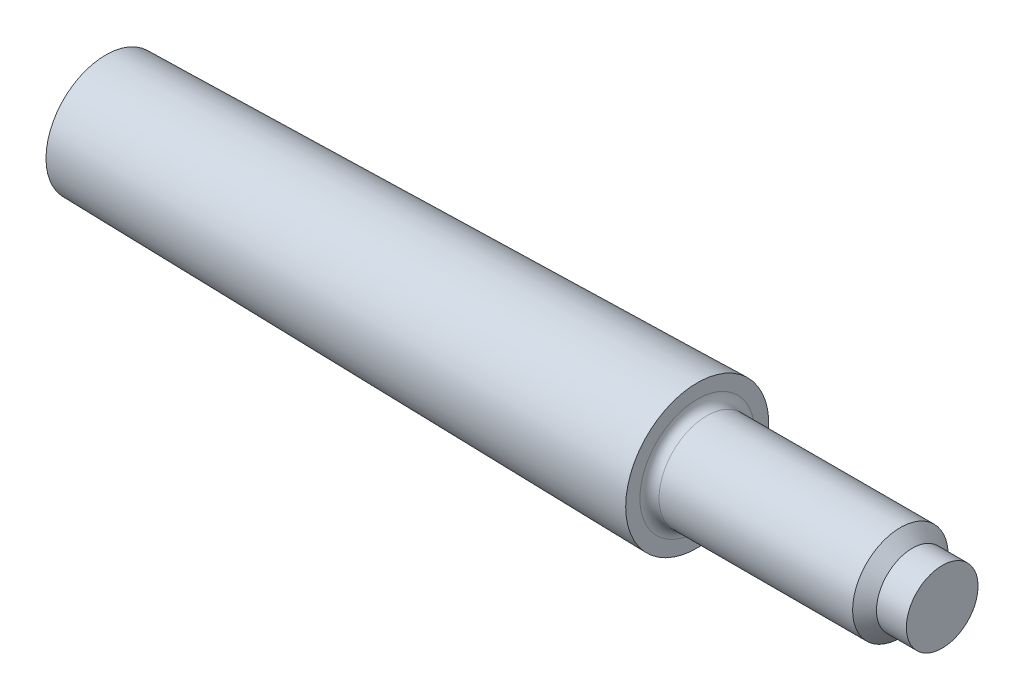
ISO-10303-21;
HEADER;
FILE_DESCRIPTION(('STEP AP214'),'2;1');
FILE_NAME('part.step','',(''),(''),'','','');
FILE_SCHEMA(('AUTOMOTIVE_DESIGN { 1 0 10303 214 1 1 1 1 }'));
ENDSEC;
DATA;
#1=APPLICATION_CONTEXT('core data for automotive mechanical design processes');
#2=APPLICATION_PROTOCOL_DEFINITION('international standard','automotive_design',2000,#1);
#3=PRODUCT_CONTEXT('',#1,'mechanical');
#4=PRODUCT('Part','Part','',(#3));
#5=PRODUCT_RELATED_PRODUCT_CATEGORY('part','',(#4));
#6=PRODUCT_DEFINITION_FORMATION('','',#4);
#7=PRODUCT_DEFINITION_CONTEXT('part definition',#1,'design');
#8=PRODUCT_DEFINITION('design','',#6,#7);
#9=PRODUCT_DEFINITION_SHAPE('','',#8);
#10=(LENGTH_UNIT() NAMED_UNIT(*) SI_UNIT(.MILLI.,.METRE.));
#11=(NAMED_UNIT(*) PLANE_ANGLE_UNIT() SI_UNIT($,.RADIAN.));
#12=(NAMED_UNIT(*) SI_UNIT($,.STERADIAN.) SOLID_ANGLE_UNIT());
#13=UNCERTAINTY_MEASURE_WITH_UNIT(LENGTH_MEASURE(1.E-05),#10,'distance_accuracy_value','');
#14=(GEOMETRIC_REPRESENTATION_CONTEXT(3) GLOBAL_UNCERTAINTY_ASSIGNED_CONTEXT((#13)) GLOBAL_UNIT_ASSIGNED_CONTEXT((#10,
#11,#12)) REPRESENTATION_CONTEXT('',''));
#15=CARTESIAN_POINT('',(0.,0.,0.));
#16=DIRECTION('',(0.,0.,1.));
#17=DIRECTION('',(1.,0.,0.));
#18=AXIS2_PLACEMENT_3D('',#15,#16,#17);
#19=CARTESIAN_POINT('',(-99.,0.,0.));
#20=DIRECTION('',(1.,0.,0.));
#21=DIRECTION('',(0.,0.,-1.));
#22=AXIS2_PLACEMENT_3D('',#19,#20,#21);
#23=PLANE('',#22);
#24=CARTESIAN_POINT('',(-99.,0.,0.));
#25=DIRECTION('',(-1.,0.,0.));
#26=DIRECTION('',(0.,0.,1.));
#27=AXIS2_PLACEMENT_3D('',#24,#25,#26);
#28=CIRCLE('',#27,10.);
#29=CARTESIAN_POINT('',(-99.,0.,10.));
#30=VERTEX_POINT('',#29);
#31=EDGE_CURVE('E42',#30,#30,#28,.T.);
#32=ORIENTED_EDGE('',*,*,#31,.T.);
#33=EDGE_LOOP('',(#32));
#34=FACE_BOUND('',#33,.T.);
#35=ADVANCED_FACE('F31',(#34),#23,.F.);
#36=CARTESIAN_POINT('',(0.,0.,0.));
#37=DIRECTION('',(1.,0.,0.));
#38=DIRECTION('',(0.,0.,-1.));
#39=AXIS2_PLACEMENT_3D('',#36,#37,#38);
#40=CONICAL_SURFACE('',#39,11.98,0.0199973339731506);
#41=ORIENTED_EDGE('',*,*,#31,.F.);
#42=EDGE_LOOP('',(#41));
#43=FACE_BOUND('',#42,.T.);
#44=CARTESIAN_POINT('',(0.,0.,0.));
#45=DIRECTION('',(-1.,0.,0.));
#46=DIRECTION('',(0.,0.,1.));
#47=AXIS2_PLACEMENT_3D('',#44,#45,#46);
#48=CIRCLE('',#47,11.98);
#49=CARTESIAN_POINT('',(0.,0.,11.98));
#50=VERTEX_POINT('',#49);
#51=EDGE_CURVE('E46',#50,#50,#48,.T.);
#52=ORIENTED_EDGE('',*,*,#51,.T.);
#53=EDGE_LOOP('',(#52));
#54=FACE_BOUND('',#53,.T.);
#55=ADVANCED_FACE('F75',(#43,#54),#40,.T.);
#56=CARTESIAN_POINT('',(0.,11.98,0.));
#57=DIRECTION('',(-1.,0.,0.));
#58=DIRECTION('',(0.,0.,1.));
#59=AXIS2_PLACEMENT_3D('',#56,#57,#58);
#60=PLANE('',#59);
#61=CARTESIAN_POINT('',(0.,0.,0.));
#62=DIRECTION('',(-1.,0.,0.));
#63=DIRECTION('',(0.,0.,1.));
#64=AXIS2_PLACEMENT_3D('',#61,#62,#63);
#65=CIRCLE('',#64,9.6);
#66=CARTESIAN_POINT('',(0.,0.,9.6));
#67=VERTEX_POINT('',#66);
#68=EDGE_CURVE('E38',#67,#67,#65,.T.);
#69=ORIENTED_EDGE('',*,*,#68,.T.);
#70=EDGE_LOOP('',(#69));
#71=FACE_BOUND('',#70,.T.);
#72=ORIENTED_EDGE('',*,*,#51,.F.);
#73=EDGE_LOOP('',(#72));
#74=FACE_BOUND('',#73,.T.);
#75=ADVANCED_FACE('F80',(#71,#74),#60,.F.);
#76=CARTESIAN_POINT('',(-250.,0.,0.));
#77=DIRECTION('',(-1.,0.,0.));
#78=DIRECTION('',(0.,0.,1.));
#79=AXIS2_PLACEMENT_3D('',#76,#77,#78);
#80=CYLINDRICAL_SURFACE('',#79,8.);
#81=CARTESIAN_POINT('',(1.59999999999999,0.,0.));
#82=DIRECTION('',(-1.,0.,0.));
#83=DIRECTION('',(0.,0.,1.));
#84=AXIS2_PLACEMENT_3D('',#81,#82,#83);
#85=CIRCLE('',#84,8.);
#86=CARTESIAN_POINT('',(1.59999999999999,0.,8.));
#87=VERTEX_POINT('',#86);
#88=EDGE_CURVE('E10',#87,#87,#85,.F.);
#89=ORIENTED_EDGE('',*,*,#88,.T.);
#90=EDGE_LOOP('',(#89));
#91=FACE_BOUND('',#90,.T.);
#92=CARTESIAN_POINT('',(34.,0.,0.));
#93=DIRECTION('',(-1.,0.,0.));
#94=DIRECTION('',(0.,0.,1.));
#95=AXIS2_PLACEMENT_3D('',#92,#93,#94);
#96=CIRCLE('',#95,8.);
#97=CARTESIAN_POINT('',(34.,0.,8.));
#98=VERTEX_POINT('',#97);
#99=EDGE_CURVE('E51',#98,#98,#96,.T.);
#100=ORIENTED_EDGE('',*,*,#99,.T.);
#101=EDGE_LOOP('',(#100));
#102=FACE_BOUND('',#101,.T.);
#103=ADVANCED_FACE('F86',(#91,#102),#80,.T.);
#104=CARTESIAN_POINT('',(36.,0.,0.));
#105=DIRECTION('',(-1.,0.,0.));
#106=DIRECTION('',(0.,0.,1.));
#107=AXIS2_PLACEMENT_3D('',#104,#105,#106);
#108=CONICAL_SURFACE('',#107,6.,0.785398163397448);
#109=ORIENTED_EDGE('',*,*,#99,.F.);
#110=EDGE_LOOP('',(#109));
#111=FACE_BOUND('',#110,.T.);
#112=CARTESIAN_POINT('',(36.,0.,0.));
#113=DIRECTION('',(-1.,0.,0.));
#114=DIRECTION('',(0.,0.,1.));
#115=AXIS2_PLACEMENT_3D('',#112,#113,#114);
#116=CIRCLE('',#115,6.);
#117=CARTESIAN_POINT('',(36.,0.,6.));
#118=VERTEX_POINT('',#117);
#119=EDGE_CURVE('E54',#118,#118,#116,.T.);
#120=ORIENTED_EDGE('',*,*,#119,.T.);
#121=EDGE_LOOP('',(#120));
#122=FACE_BOUND('',#121,.T.);
#123=ADVANCED_FACE('F71',(#111,#122),#108,.T.);
#124=CARTESIAN_POINT('',(-250.,0.,0.));
#125=DIRECTION('',(-1.,0.,0.));
#126=DIRECTION('',(0.,0.,1.));
#127=AXIS2_PLACEMENT_3D('',#124,#125,#126);
#128=CYLINDRICAL_SURFACE('',#127,6.);
#129=ORIENTED_EDGE('',*,*,#119,.F.);
#130=EDGE_LOOP('',(#129));
#131=FACE_BOUND('',#130,.T.);
#132=CARTESIAN_POINT('',(41.,0.,0.));
#133=DIRECTION('',(-1.,0.,0.));
#134=DIRECTION('',(0.,0.,1.));
#135=AXIS2_PLACEMENT_3D('',#132,#133,#134);
#136=CIRCLE('',#135,6.);
#137=CARTESIAN_POINT('',(41.,0.,6.));
#138=VERTEX_POINT('',#137);
#139=EDGE_CURVE('E57',#138,#138,#136,.T.);
#140=ORIENTED_EDGE('',*,*,#139,.T.);
#141=EDGE_LOOP('',(#140));
#142=FACE_BOUND('',#141,.T.);
#143=ADVANCED_FACE('F61',(#131,#142),#128,.T.);
#144=CARTESIAN_POINT('',(41.,6.,0.));
#145=DIRECTION('',(-1.,0.,0.));
#146=DIRECTION('',(0.,0.,1.));
#147=AXIS2_PLACEMENT_3D('',#144,#145,#146);
#148=PLANE('',#147);
#149=ORIENTED_EDGE('',*,*,#139,.F.);
#150=EDGE_LOOP('',(#149));
#151=FACE_BOUND('',#150,.T.);
#152=ADVANCED_FACE('F63',(#151),#148,.F.);
#153=CARTESIAN_POINT('',(1.59999999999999,0.,0.));
#154=DIRECTION('',(-1.,0.,0.));
#155=DIRECTION('',(0.,0.,1.));
#156=AXIS2_PLACEMENT_3D('',#153,#154,#155);
#157=TOROIDAL_SURFACE('',#156,9.6,1.6);
#158=ORIENTED_EDGE('',*,*,#88,.F.);
#159=EDGE_LOOP('',(#158));
#160=FACE_BOUND('',#159,.T.);
#161=ORIENTED_EDGE('',*,*,#68,.F.);
#162=EDGE_LOOP('',(#161));
#163=FACE_BOUND('',#162,.T.);
#164=ADVANCED_FACE('F33',(#160,#163),#157,.F.);
#165=CLOSED_SHELL('',(#35,#55,#75,#103,#123,#143,#152,#164));
#166=MANIFOLD_SOLID_BREP('B2',#165);
#167=ADVANCED_BREP_SHAPE_REPRESENTATION('',(#18,#166),#14);
#168=SHAPE_DEFINITION_REPRESENTATION(#9,#167);
ENDSEC;
END-ISO-10303-21;
